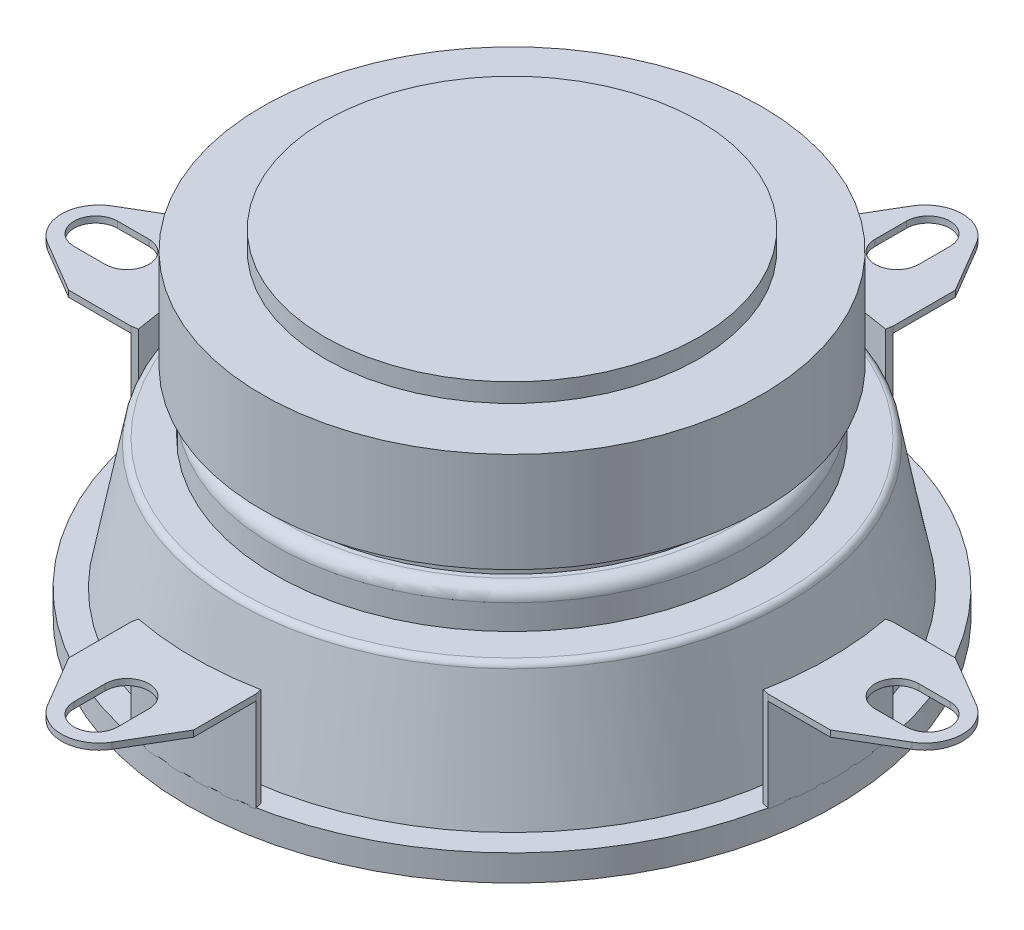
from build123d import *

# Parameters (mm, degrees)
BOSS_EXTRUDE1_START = 10
BOSS_EXTRUDE1_DEPTH = 0.5
EXTRUDE_THIN1_DEPTH = 8
CUT_EXTRUDE1_DEPTH  = 9
CIRPATTERN2_COUNT   = 4


with BuildPart() as part:
    # Sketch2 → Revolve1 (revolve)
    with BuildSketch(Plane.XY, mode=Mode.PRIVATE) as revolve1_sk:
        with BuildLine():
            Line((26, 0), (26, 2.094374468))
            Line((26, 2.094374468), (24, 2.094374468))
            Line((24, 2.094374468), (22.077962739, 12.094374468))
            ThreePointArc((22.077962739, 12.094374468), (21.905393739, 12.385478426), (21.586950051, 12.5))
            Line((21.586950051, 12.5), (19, 12.5))
            Line((19, 12.5), (19, 14.5))
            ThreePointArc((19, 14.5), (18.707106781, 15.207106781), (18, 15.5))
            Line((18, 15.5), (17.617867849, 15.5))
            Line((17.617867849, 15.5), (17.617867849, 17.5))
            Line((17.617867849, 17.5), (20, 17.5))
            Line((20, 17.5), (20, 25.5))
            Line((20, 25.5), (15, 25.5))
            Line((15, 25.5), (15, 27))
            Line((15, 27), (0, 27))
            Line((0, 27), (0, 0))
            Line((0, 0), (26, 0))
        make_face()
    revolve(revolve1_sk.sketch.rotate(Axis((0, 0, 0), (0, 1, 0)), 90), axis=Axis((0, 0, 0), (0, 1, 0)))

    # Sketch3 → Cut-Revolve1 (revolve, cut)
    with BuildSketch(Plane.XY, mode=Mode.PRIVATE) as cut_revolve1_sk:
        with BuildLine():
            Line((21.189393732, 3.016721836), (23.008078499, 3.016721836))
            Line((23.008078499, 3.016721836), (23.587903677, 0))
            Line((23.587903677, 0), (23.587903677, -1.369873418))
            Line((23.587903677, -1.369873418), (0, -1.005415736))
            Line((0, -1.005415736), (0, 4.959575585))
            ThreePointArc((0, 4.959575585), (8.251703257, 4.256555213), (16.265552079, 2.167758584))
            ThreePointArc((16.265552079, 2.167758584), (19.168156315, 0.036351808), (21.189393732, 3.016721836))
        make_face()
    revolve(cut_revolve1_sk.sketch.rotate(Axis((0, 0, 0), (0, 1, 0)), 90), axis=Axis((0, 0, 0), (0, 1, 0)), mode=Mode.SUBTRACT)


with BuildPart() as body_2:
    # Sketch4 → Boss-Extrude1 (new body)
    with BuildSketch(Plane(origin=(0, 0, 0), x_dir=(1, 0, 0), z_dir=(0, 1, 0)).offset(BOSS_EXTRUDE1_START)):
        with BuildLine():
            Line((-5, -25.514701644), (-5, -30.514701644))
            Line((-5, -30.514701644), (-2.584650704, -34.613693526))
            ThreePointArc((-2.584650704, -34.613693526), (0, -36.090676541), (2.584650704, -34.613693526))
            Line((2.584650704, -34.613693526), (5, -30.514701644))
            Line((5, -30.514701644), (5, -25.514701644))
            ThreePointArc((5, -25.514701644), (0, -26), (-5, -25.514701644))
        make_face()
    extrude(amount=-BOSS_EXTRUDE1_DEPTH)

    # Sketch5 → Extrude-Thin1 (add)
    with BuildSketch(Plane(origin=(0, 10, 0), x_dir=(-1, 0, 0), z_dir=(0, 1, 0))):
        with BuildLine():
            ThreePointArc((5, 25.514701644), (0, 26), (-5, 25.514701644))
            Line((-5, 25.514701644), (-4.903846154, 25.024034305))
            ThreePointArc((-4.903846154, 25.024034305), (0, 25.5), (4.903846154, 25.024034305))
            Line((4.903846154, 25.024034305), (5, 25.514701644))
        make_face()
    extrude(amount=-EXTRUDE_THIN1_DEPTH)

    # Sketch6 → Cut-Extrude1 (cut)
    with BuildSketch(Plane(origin=(0, 10, 0), x_dir=(-1, 0, 0), z_dir=(0, 1, 0))):
        with BuildLine():
            Line((-1.75, 30.840676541), (-1.75, 33.340676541))
            ThreePointArc((-1.75, 33.340676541), (0, 35.090676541), (1.75, 33.340676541))
            Line((1.75, 33.340676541), (1.75, 30.840676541))
            ThreePointArc((1.75, 30.840676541), (0, 29.090676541), (-1.75, 30.840676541))
        make_face()
    extrude(amount=-CUT_EXTRUDE1_DEPTH, mode=Mode.SUBTRACT)


with BuildPart() as cirpattern2_1:
    # CirPattern2: pattern copy
    add(body_2.part.rotate(Axis((0, 0, 0), (0, 1, 0)), 1 * 360 / CIRPATTERN2_COUNT))


with BuildPart() as cirpattern2_2:
    # CirPattern2: pattern copy
    add(body_2.part.rotate(Axis((0, 0, 0), (0, 1, 0)), 2 * 360 / CIRPATTERN2_COUNT))


with BuildPart() as cirpattern2_3:
    # CirPattern2: pattern copy
    add(body_2.part.rotate(Axis((0, 0, 0), (0, 1, 0)), 3 * 360 / CIRPATTERN2_COUNT))


solid = Compound([part.part, body_2.part, cirpattern2_1.part, cirpattern2_2.part, cirpattern2_3.part])
